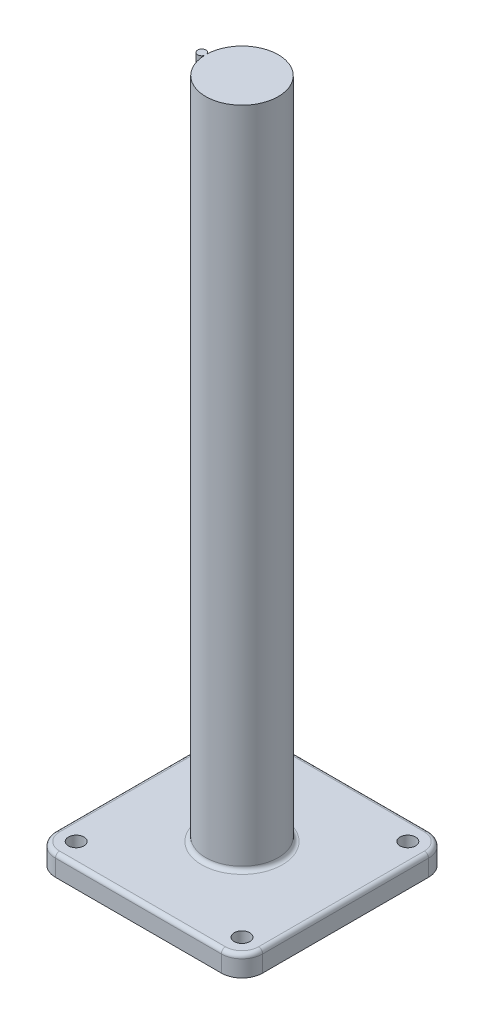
ISO-10303-21;
HEADER;
FILE_DESCRIPTION(('STEP AP214'),'2;1');
FILE_NAME('part.step','',(''),(''),'','','');
FILE_SCHEMA(('AUTOMOTIVE_DESIGN { 1 0 10303 214 1 1 1 1 }'));
ENDSEC;
DATA;
#1=APPLICATION_CONTEXT('core data for automotive mechanical design processes');
#2=APPLICATION_PROTOCOL_DEFINITION('international standard','automotive_design',2000,#1);
#3=PRODUCT_CONTEXT('',#1,'mechanical');
#4=PRODUCT('Part','Part','',(#3));
#5=PRODUCT_RELATED_PRODUCT_CATEGORY('part','',(#4));
#6=PRODUCT_DEFINITION_FORMATION('','',#4);
#7=PRODUCT_DEFINITION_CONTEXT('part definition',#1,'design');
#8=PRODUCT_DEFINITION('design','',#6,#7);
#9=PRODUCT_DEFINITION_SHAPE('','',#8);
#10=(LENGTH_UNIT() NAMED_UNIT(*) SI_UNIT(.MILLI.,.METRE.));
#11=(NAMED_UNIT(*) PLANE_ANGLE_UNIT() SI_UNIT($,.RADIAN.));
#12=(NAMED_UNIT(*) SI_UNIT($,.STERADIAN.) SOLID_ANGLE_UNIT());
#13=UNCERTAINTY_MEASURE_WITH_UNIT(LENGTH_MEASURE(1.E-05),#10,'distance_accuracy_value','');
#14=(GEOMETRIC_REPRESENTATION_CONTEXT(3) GLOBAL_UNCERTAINTY_ASSIGNED_CONTEXT((#13)) GLOBAL_UNIT_ASSIGNED_CONTEXT((#10,
#11,#12)) REPRESENTATION_CONTEXT('',''));
#15=CARTESIAN_POINT('',(0.,0.,0.));
#16=DIRECTION('',(0.,0.,1.));
#17=DIRECTION('',(1.,0.,0.));
#18=AXIS2_PLACEMENT_3D('',#15,#16,#17);
#19=CARTESIAN_POINT('',(50.8000000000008,12.6999999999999,50.8));
#20=DIRECTION('',(0.,0.999999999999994,0.));
#21=DIRECTION('',(0.,0.,1.));
#22=AXIS2_PLACEMENT_3D('',#19,#20,#21);
#23=PLANE('',#22);
#24=CARTESIAN_POINT('',(-24.6380000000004,12.6999999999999,0.));
#25=DIRECTION('',(0.,0.999999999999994,0.));
#26=DIRECTION('',(0.,0.,1.));
#27=AXIS2_PLACEMENT_3D('',#24,#25,#26);
#28=CIRCLE('',#27,2.54);
#29=CARTESIAN_POINT('',(-24.6343994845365,12.6999999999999,2.53999744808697));
#30=VERTEX_POINT('',#29);
#31=CARTESIAN_POINT('',(-24.6343994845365,12.6999999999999,-2.53999744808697));
#32=VERTEX_POINT('',#31);
#33=EDGE_CURVE('E148',#30,#32,#28,.F.);
#34=ORIENTED_EDGE('',*,*,#33,.T.);
#35=CARTESIAN_POINT('',(0.,12.6999999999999,0.));
#36=DIRECTION('',(0.,0.999999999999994,0.));
#37=DIRECTION('',(0.,0.,1.));
#38=AXIS2_PLACEMENT_3D('',#35,#36,#37);
#39=CIRCLE('',#38,24.765);
#40=EDGE_CURVE('E157',#32,#30,#39,.F.);
#41=ORIENTED_EDGE('',*,*,#40,.T.);
#42=EDGE_LOOP('',(#34,#41));
#43=FACE_BOUND('',#42,.T.);
#44=DIRECTION('',(0.,0.,1.));
#45=VECTOR('',#44,1.);
#46=CARTESIAN_POINT('',(-60.9600000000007,12.6999999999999,50.7999999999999));
#47=LINE('',#46,#45);
#48=CARTESIAN_POINT('',(-60.9600000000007,12.6999999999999,-50.7999999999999));
#49=VERTEX_POINT('',#48);
#50=CARTESIAN_POINT('',(-60.9600000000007,12.6999999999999,50.8));
#51=VERTEX_POINT('',#50);
#52=EDGE_CURVE('E179',#49,#51,#47,.T.);
#53=ORIENTED_EDGE('',*,*,#52,.T.);
#54=CARTESIAN_POINT('',(-50.8000000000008,12.6999999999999,50.8));
#55=DIRECTION('',(0.,0.999999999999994,0.));
#56=DIRECTION('',(0.,0.,1.));
#57=AXIS2_PLACEMENT_3D('',#54,#55,#56);
#58=CIRCLE('',#57,10.16);
#59=CARTESIAN_POINT('',(-50.8000000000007,12.6999999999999,60.96));
#60=VERTEX_POINT('',#59);
#61=EDGE_CURVE('E181',#51,#60,#58,.T.);
#62=ORIENTED_EDGE('',*,*,#61,.T.);
#63=DIRECTION('',(1.00000000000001,0.,0.));
#64=VECTOR('',#63,1.);
#65=CARTESIAN_POINT('',(50.8000000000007,12.6999999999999,60.96));
#66=LINE('',#65,#64);
#67=CARTESIAN_POINT('',(50.8000000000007,12.6999999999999,60.96));
#68=VERTEX_POINT('',#67);
#69=EDGE_CURVE('E161',#60,#68,#66,.T.);
#70=ORIENTED_EDGE('',*,*,#69,.T.);
#71=CARTESIAN_POINT('',(50.8000000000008,12.6999999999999,50.8));
#72=DIRECTION('',(0.,0.999999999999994,0.));
#73=DIRECTION('',(0.,0.,1.));
#74=AXIS2_PLACEMENT_3D('',#71,#72,#73);
#75=CIRCLE('',#74,10.16);
#76=CARTESIAN_POINT('',(60.9600000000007,12.6999999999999,50.7999999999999));
#77=VERTEX_POINT('',#76);
#78=EDGE_CURVE('E164',#68,#77,#75,.T.);
#79=ORIENTED_EDGE('',*,*,#78,.T.);
#80=DIRECTION('',(0.,0.,-1.));
#81=VECTOR('',#80,1.);
#82=CARTESIAN_POINT('',(60.9600000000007,12.6999999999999,-50.7999999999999));
#83=LINE('',#82,#81);
#84=CARTESIAN_POINT('',(60.9600000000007,12.6999999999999,-50.8));
#85=VERTEX_POINT('',#84);
#86=EDGE_CURVE('E171',#77,#85,#83,.T.);
#87=ORIENTED_EDGE('',*,*,#86,.T.);
#88=CARTESIAN_POINT('',(50.8000000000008,12.6999999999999,-50.8));
#89=DIRECTION('',(0.,0.999999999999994,0.));
#90=DIRECTION('',(0.,0.,1.));
#91=AXIS2_PLACEMENT_3D('',#88,#89,#90);
#92=CIRCLE('',#91,10.16);
#93=CARTESIAN_POINT('',(50.8000000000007,12.6999999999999,-60.96));
#94=VERTEX_POINT('',#93);
#95=EDGE_CURVE('E173',#85,#94,#92,.T.);
#96=ORIENTED_EDGE('',*,*,#95,.T.);
#97=DIRECTION('',(-1.00000000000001,0.,0.));
#98=VECTOR('',#97,1.);
#99=CARTESIAN_POINT('',(-50.8000000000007,12.6999999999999,-60.96));
#100=LINE('',#99,#98);
#101=CARTESIAN_POINT('',(-50.8000000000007,12.6999999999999,-60.96));
#102=VERTEX_POINT('',#101);
#103=EDGE_CURVE('E175',#94,#102,#100,.T.);
#104=ORIENTED_EDGE('',*,*,#103,.T.);
#105=CARTESIAN_POINT('',(-50.8000000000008,12.6999999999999,-50.8));
#106=DIRECTION('',(0.,0.999999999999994,0.));
#107=DIRECTION('',(0.,0.,1.));
#108=AXIS2_PLACEMENT_3D('',#105,#106,#107);
#109=CIRCLE('',#108,10.16);
#110=EDGE_CURVE('E177',#102,#49,#109,.T.);
#111=ORIENTED_EDGE('',*,*,#110,.T.);
#112=EDGE_LOOP('',(#53,#62,#70,#79,#87,#96,#104,#111));
#113=FACE_BOUND('',#112,.T.);
#114=CARTESIAN_POINT('',(50.8000000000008,12.6999999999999,50.8));
#115=DIRECTION('',(0.,0.999999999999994,0.));
#116=DIRECTION('',(0.,0.,1.));
#117=AXIS2_PLACEMENT_3D('',#114,#115,#116);
#118=CIRCLE('',#117,4.7625);
#119=CARTESIAN_POINT('',(50.8000000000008,12.6999999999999,46.0375));
#120=VERTEX_POINT('',#119);
#121=EDGE_CURVE('E351',#120,#120,#118,.T.);
#122=ORIENTED_EDGE('',*,*,#121,.F.);
#123=EDGE_LOOP('',(#122));
#124=FACE_BOUND('',#123,.T.);
#125=CARTESIAN_POINT('',(-50.8000000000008,12.6999999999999,-50.8));
#126=DIRECTION('',(0.,0.999999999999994,0.));
#127=DIRECTION('',(0.,0.,1.));
#128=AXIS2_PLACEMENT_3D('',#125,#126,#127);
#129=CIRCLE('',#128,4.7625);
#130=CARTESIAN_POINT('',(-50.8000000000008,12.6999999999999,-55.5625));
#131=VERTEX_POINT('',#130);
#132=EDGE_CURVE('E363',#131,#131,#129,.T.);
#133=ORIENTED_EDGE('',*,*,#132,.F.);
#134=EDGE_LOOP('',(#133));
#135=FACE_BOUND('',#134,.T.);
#136=CARTESIAN_POINT('',(50.8000000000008,12.6999999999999,-50.8));
#137=DIRECTION('',(0.,0.999999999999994,0.));
#138=DIRECTION('',(0.,0.,1.));
#139=AXIS2_PLACEMENT_3D('',#136,#137,#138);
#140=CIRCLE('',#139,4.7625);
#141=CARTESIAN_POINT('',(50.8000000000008,12.6999999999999,-55.5625));
#142=VERTEX_POINT('',#141);
#143=EDGE_CURVE('E357',#142,#142,#140,.T.);
#144=ORIENTED_EDGE('',*,*,#143,.F.);
#145=EDGE_LOOP('',(#144));
#146=FACE_BOUND('',#145,.T.);
#147=CARTESIAN_POINT('',(-50.8000000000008,12.6999999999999,50.8));
#148=DIRECTION('',(0.,0.999999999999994,0.));
#149=DIRECTION('',(0.,0.,1.));
#150=AXIS2_PLACEMENT_3D('',#147,#148,#149);
#151=CIRCLE('',#150,4.7625);
#152=CARTESIAN_POINT('',(-50.8000000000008,12.6999999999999,46.0375));
#153=VERTEX_POINT('',#152);
#154=EDGE_CURVE('E345',#153,#153,#151,.T.);
#155=ORIENTED_EDGE('',*,*,#154,.F.);
#156=EDGE_LOOP('',(#155));
#157=FACE_BOUND('',#156,.T.);
#158=ADVANCED_FACE('F36',(#43,#113,#124,#135,#146,#157),#23,.T.);
#159=CARTESIAN_POINT('',(50.8000000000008,0.,50.8));
#160=DIRECTION('',(0.,0.999999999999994,0.));
#161=DIRECTION('',(0.,0.,1.));
#162=AXIS2_PLACEMENT_3D('',#159,#160,#161);
#163=PLANE('',#162);
#164=CARTESIAN_POINT('',(50.8000000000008,0.,50.8));
#165=DIRECTION('',(0.,0.999999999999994,0.));
#166=DIRECTION('',(0.,0.,1.));
#167=AXIS2_PLACEMENT_3D('',#164,#165,#166);
#168=CIRCLE('',#167,4.7625);
#169=CARTESIAN_POINT('',(50.8000000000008,0.,46.0375));
#170=VERTEX_POINT('',#169);
#171=EDGE_CURVE('E348',#170,#170,#168,.T.);
#172=ORIENTED_EDGE('',*,*,#171,.T.);
#173=EDGE_LOOP('',(#172));
#174=FACE_BOUND('',#173,.T.);
#175=CARTESIAN_POINT('',(-50.8000000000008,0.,-50.8));
#176=DIRECTION('',(0.,0.999999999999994,0.));
#177=DIRECTION('',(0.,0.,1.));
#178=AXIS2_PLACEMENT_3D('',#175,#176,#177);
#179=CIRCLE('',#178,4.7625);
#180=CARTESIAN_POINT('',(-50.8000000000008,0.,-55.5625));
#181=VERTEX_POINT('',#180);
#182=EDGE_CURVE('E360',#181,#181,#179,.T.);
#183=ORIENTED_EDGE('',*,*,#182,.T.);
#184=EDGE_LOOP('',(#183));
#185=FACE_BOUND('',#184,.T.);
#186=CARTESIAN_POINT('',(50.8000000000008,0.,50.8));
#187=DIRECTION('',(0.,0.999999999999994,0.));
#188=DIRECTION('',(0.,0.,1.));
#189=AXIS2_PLACEMENT_3D('',#186,#187,#188);
#190=CIRCLE('',#189,12.7);
#191=CARTESIAN_POINT('',(50.8000000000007,0.,63.5));
#192=VERTEX_POINT('',#191);
#193=CARTESIAN_POINT('',(63.5000000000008,0.,50.7999999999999));
#194=VERTEX_POINT('',#193);
#195=EDGE_CURVE('E366',#192,#194,#190,.T.);
#196=ORIENTED_EDGE('',*,*,#195,.F.);
#197=DIRECTION('',(1.00000000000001,0.,0.));
#198=VECTOR('',#197,1.);
#199=CARTESIAN_POINT('',(-50.8000000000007,0.,63.5));
#200=LINE('',#199,#198);
#201=CARTESIAN_POINT('',(-50.8000000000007,0.,63.5));
#202=VERTEX_POINT('',#201);
#203=EDGE_CURVE('E379',#202,#192,#200,.T.);
#204=ORIENTED_EDGE('',*,*,#203,.F.);
#205=CARTESIAN_POINT('',(-50.8000000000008,0.,50.8));
#206=DIRECTION('',(0.,0.999999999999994,0.));
#207=DIRECTION('',(0.,0.,-1.));
#208=AXIS2_PLACEMENT_3D('',#205,#206,#207);
#209=CIRCLE('',#208,12.7);
#210=CARTESIAN_POINT('',(-63.5000000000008,0.,50.7999999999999));
#211=VERTEX_POINT('',#210);
#212=EDGE_CURVE('E302',#211,#202,#209,.T.);
#213=ORIENTED_EDGE('',*,*,#212,.F.);
#214=DIRECTION('',(0.,0.,1.));
#215=VECTOR('',#214,1.);
#216=CARTESIAN_POINT('',(-63.5000000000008,0.,50.7999999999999));
#217=LINE('',#216,#215);
#218=CARTESIAN_POINT('',(-63.5000000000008,0.,-50.7999999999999));
#219=VERTEX_POINT('',#218);
#220=EDGE_CURVE('E376',#219,#211,#217,.T.);
#221=ORIENTED_EDGE('',*,*,#220,.F.);
#222=CARTESIAN_POINT('',(-50.8000000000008,0.,-50.8));
#223=DIRECTION('',(0.,0.999999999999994,0.));
#224=DIRECTION('',(0.,0.,-1.));
#225=AXIS2_PLACEMENT_3D('',#222,#223,#224);
#226=CIRCLE('',#225,12.7);
#227=CARTESIAN_POINT('',(-50.8000000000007,0.,-63.5));
#228=VERTEX_POINT('',#227);
#229=EDGE_CURVE('E323',#228,#219,#226,.T.);
#230=ORIENTED_EDGE('',*,*,#229,.F.);
#231=DIRECTION('',(-1.00000000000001,0.,0.));
#232=VECTOR('',#231,1.);
#233=CARTESIAN_POINT('',(-50.8000000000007,0.,-63.5));
#234=LINE('',#233,#232);
#235=CARTESIAN_POINT('',(50.8000000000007,0.,-63.5));
#236=VERTEX_POINT('',#235);
#237=EDGE_CURVE('E372',#236,#228,#234,.T.);
#238=ORIENTED_EDGE('',*,*,#237,.F.);
#239=CARTESIAN_POINT('',(50.8000000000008,0.,-50.8));
#240=DIRECTION('',(0.,0.999999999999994,0.));
#241=DIRECTION('',(0.,0.,-1.));
#242=AXIS2_PLACEMENT_3D('',#239,#240,#241);
#243=CIRCLE('',#242,12.7);
#244=CARTESIAN_POINT('',(63.5000000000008,0.,-50.7999999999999));
#245=VERTEX_POINT('',#244);
#246=EDGE_CURVE('E370',#245,#236,#243,.T.);
#247=ORIENTED_EDGE('',*,*,#246,.F.);
#248=DIRECTION('',(0.,0.,-1.));
#249=VECTOR('',#248,1.);
#250=CARTESIAN_POINT('',(63.5000000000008,0.,50.7999999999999));
#251=LINE('',#250,#249);
#252=EDGE_CURVE('E257',#194,#245,#251,.T.);
#253=ORIENTED_EDGE('',*,*,#252,.F.);
#254=EDGE_LOOP('',(#196,#204,#213,#221,#230,#238,#247,#253));
#255=FACE_BOUND('',#254,.T.);
#256=CARTESIAN_POINT('',(50.8000000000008,0.,-50.8));
#257=DIRECTION('',(0.,0.999999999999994,0.));
#258=DIRECTION('',(0.,0.,1.));
#259=AXIS2_PLACEMENT_3D('',#256,#257,#258);
#260=CIRCLE('',#259,4.7625);
#261=CARTESIAN_POINT('',(50.8000000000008,0.,-55.5625));
#262=VERTEX_POINT('',#261);
#263=EDGE_CURVE('E354',#262,#262,#260,.T.);
#264=ORIENTED_EDGE('',*,*,#263,.T.);
#265=EDGE_LOOP('',(#264));
#266=FACE_BOUND('',#265,.T.);
#267=CARTESIAN_POINT('',(-50.8000000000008,0.,50.8));
#268=DIRECTION('',(0.,0.999999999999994,0.));
#269=DIRECTION('',(0.,0.,1.));
#270=AXIS2_PLACEMENT_3D('',#267,#268,#269);
#271=CIRCLE('',#270,4.7625);
#272=CARTESIAN_POINT('',(-50.8000000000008,0.,46.0375));
#273=VERTEX_POINT('',#272);
#274=EDGE_CURVE('E342',#273,#273,#271,.T.);
#275=ORIENTED_EDGE('',*,*,#274,.T.);
#276=EDGE_LOOP('',(#275));
#277=FACE_BOUND('',#276,.T.);
#278=ADVANCED_FACE('F213',(#174,#185,#255,#266,#277),#163,.F.);
#279=CARTESIAN_POINT('',(50.8000000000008,12.6999999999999,50.8));
#280=DIRECTION('',(0.,-0.999999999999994,0.));
#281=DIRECTION('',(0.,0.,-1.));
#282=AXIS2_PLACEMENT_3D('',#279,#280,#281);
#283=CYLINDRICAL_SURFACE('',#282,12.7);
#284=DIRECTION('',(0.,-0.999999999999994,0.));
#285=VECTOR('',#284,1.);
#286=CARTESIAN_POINT('',(63.5000000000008,12.6999999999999,50.7999999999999));
#287=LINE('',#286,#285);
#288=CARTESIAN_POINT('',(63.5000000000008,10.1599999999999,50.7999999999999));
#289=VERTEX_POINT('',#288);
#290=EDGE_CURVE('E162',#289,#194,#287,.T.);
#291=ORIENTED_EDGE('',*,*,#290,.F.);
#292=CARTESIAN_POINT('',(50.8000000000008,10.1599999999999,50.8));
#293=DIRECTION('',(0.,0.999999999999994,0.));
#294=DIRECTION('',(0.,0.,1.));
#295=AXIS2_PLACEMENT_3D('',#292,#293,#294);
#296=CIRCLE('',#295,12.7);
#297=CARTESIAN_POINT('',(50.8000000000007,10.1599999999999,63.5));
#298=VERTEX_POINT('',#297);
#299=EDGE_CURVE('E64',#289,#298,#296,.F.);
#300=ORIENTED_EDGE('',*,*,#299,.T.);
#301=DIRECTION('',(0.,-0.999999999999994,0.));
#302=VECTOR('',#301,1.);
#303=CARTESIAN_POINT('',(50.8000000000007,12.6999999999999,63.5));
#304=LINE('',#303,#302);
#305=EDGE_CURVE('E298',#298,#192,#304,.T.);
#306=ORIENTED_EDGE('',*,*,#305,.T.);
#307=ORIENTED_EDGE('',*,*,#195,.T.);
#308=EDGE_LOOP('',(#291,#300,#306,#307));
#309=FACE_BOUND('',#308,.T.);
#310=ADVANCED_FACE('F38',(#309),#283,.T.);
#311=CARTESIAN_POINT('',(63.5000000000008,12.6999999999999,50.7999999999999));
#312=DIRECTION('',(-1.00000000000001,0.,0.));
#313=DIRECTION('',(0.,0.,1.));
#314=AXIS2_PLACEMENT_3D('',#311,#312,#313);
#315=PLANE('',#314);
#316=DIRECTION('',(0.,-0.999999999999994,0.));
#317=VECTOR('',#316,1.);
#318=CARTESIAN_POINT('',(63.5000000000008,12.6999999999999,-50.7999999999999));
#319=LINE('',#318,#317);
#320=CARTESIAN_POINT('',(63.5000000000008,10.1599999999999,-50.7999999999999));
#321=VERTEX_POINT('',#320);
#322=EDGE_CURVE('E166',#321,#245,#319,.T.);
#323=ORIENTED_EDGE('',*,*,#322,.F.);
#324=DIRECTION('',(0.,0.,-1.));
#325=VECTOR('',#324,1.);
#326=CARTESIAN_POINT('',(63.5000000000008,10.1599999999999,50.7999999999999));
#327=LINE('',#326,#325);
#328=EDGE_CURVE('E195',#321,#289,#327,.F.);
#329=ORIENTED_EDGE('',*,*,#328,.T.);
#330=ORIENTED_EDGE('',*,*,#290,.T.);
#331=ORIENTED_EDGE('',*,*,#252,.T.);
#332=EDGE_LOOP('',(#323,#329,#330,#331));
#333=FACE_BOUND('',#332,.T.);
#334=ADVANCED_FACE('F245',(#333),#315,.F.);
#335=CARTESIAN_POINT('',(50.8000000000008,12.6999999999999,-50.8));
#336=DIRECTION('',(0.,-0.999999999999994,0.));
#337=DIRECTION('',(0.,0.,-1.));
#338=AXIS2_PLACEMENT_3D('',#335,#336,#337);
#339=CYLINDRICAL_SURFACE('',#338,12.7);
#340=DIRECTION('',(0.,-0.999999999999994,0.));
#341=VECTOR('',#340,1.);
#342=CARTESIAN_POINT('',(50.8000000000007,12.6999999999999,-63.5));
#343=LINE('',#342,#341);
#344=CARTESIAN_POINT('',(50.8000000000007,10.1599999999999,-63.5));
#345=VERTEX_POINT('',#344);
#346=EDGE_CURVE('E260',#345,#236,#343,.T.);
#347=ORIENTED_EDGE('',*,*,#346,.F.);
#348=CARTESIAN_POINT('',(50.8000000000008,10.1599999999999,-50.8));
#349=DIRECTION('',(0.,0.999999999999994,0.));
#350=DIRECTION('',(0.,0.,1.));
#351=AXIS2_PLACEMENT_3D('',#348,#349,#350);
#352=CIRCLE('',#351,12.7);
#353=EDGE_CURVE('E193',#345,#321,#352,.F.);
#354=ORIENTED_EDGE('',*,*,#353,.T.);
#355=ORIENTED_EDGE('',*,*,#322,.T.);
#356=ORIENTED_EDGE('',*,*,#246,.T.);
#357=EDGE_LOOP('',(#347,#354,#355,#356));
#358=FACE_BOUND('',#357,.T.);
#359=ADVANCED_FACE('F242',(#358),#339,.T.);
#360=CARTESIAN_POINT('',(-50.8000000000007,12.6999999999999,-63.5));
#361=DIRECTION('',(0.,0.,1.));
#362=DIRECTION('',(1.00000000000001,0.,0.));
#363=AXIS2_PLACEMENT_3D('',#360,#361,#362);
#364=PLANE('',#363);
#365=DIRECTION('',(0.,-0.999999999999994,0.));
#366=VECTOR('',#365,1.);
#367=CARTESIAN_POINT('',(-50.8000000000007,12.6999999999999,-63.5));
#368=LINE('',#367,#366);
#369=CARTESIAN_POINT('',(-50.8000000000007,10.1599999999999,-63.5));
#370=VERTEX_POINT('',#369);
#371=EDGE_CURVE('E325',#370,#228,#368,.T.);
#372=ORIENTED_EDGE('',*,*,#371,.F.);
#373=DIRECTION('',(-1.00000000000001,0.,0.));
#374=VECTOR('',#373,1.);
#375=CARTESIAN_POINT('',(50.8000000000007,10.1599999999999,-63.5));
#376=LINE('',#375,#374);
#377=EDGE_CURVE('E191',#370,#345,#376,.F.);
#378=ORIENTED_EDGE('',*,*,#377,.T.);
#379=ORIENTED_EDGE('',*,*,#346,.T.);
#380=ORIENTED_EDGE('',*,*,#237,.T.);
#381=EDGE_LOOP('',(#372,#378,#379,#380));
#382=FACE_BOUND('',#381,.T.);
#383=ADVANCED_FACE('F238',(#382),#364,.F.);
#384=CARTESIAN_POINT('',(-50.8000000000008,12.6999999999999,-50.8));
#385=DIRECTION('',(0.,-0.999999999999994,0.));
#386=DIRECTION('',(0.,0.,-1.));
#387=AXIS2_PLACEMENT_3D('',#384,#385,#386);
#388=CYLINDRICAL_SURFACE('',#387,12.7);
#389=DIRECTION('',(0.,-0.999999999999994,0.));
#390=VECTOR('',#389,1.);
#391=CARTESIAN_POINT('',(-63.5000000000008,12.6999999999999,-50.7999999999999));
#392=LINE('',#391,#390);
#393=CARTESIAN_POINT('',(-63.5000000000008,10.1599999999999,-50.7999999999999));
#394=VERTEX_POINT('',#393);
#395=EDGE_CURVE('E318',#394,#219,#392,.T.);
#396=ORIENTED_EDGE('',*,*,#395,.F.);
#397=CARTESIAN_POINT('',(-50.8000000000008,10.1599999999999,-50.8));
#398=DIRECTION('',(0.,0.999999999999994,0.));
#399=DIRECTION('',(0.,0.,1.));
#400=AXIS2_PLACEMENT_3D('',#397,#398,#399);
#401=CIRCLE('',#400,12.7);
#402=EDGE_CURVE('E189',#394,#370,#401,.F.);
#403=ORIENTED_EDGE('',*,*,#402,.T.);
#404=ORIENTED_EDGE('',*,*,#371,.T.);
#405=ORIENTED_EDGE('',*,*,#229,.T.);
#406=EDGE_LOOP('',(#396,#403,#404,#405));
#407=FACE_BOUND('',#406,.T.);
#408=ADVANCED_FACE('F234',(#407),#388,.T.);
#409=CARTESIAN_POINT('',(-63.5000000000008,12.6999999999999,50.7999999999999));
#410=DIRECTION('',(1.00000000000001,0.,0.));
#411=DIRECTION('',(0.,0.,-1.));
#412=AXIS2_PLACEMENT_3D('',#409,#410,#411);
#413=PLANE('',#412);
#414=DIRECTION('',(0.,-0.999999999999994,0.));
#415=VECTOR('',#414,1.);
#416=CARTESIAN_POINT('',(-63.5000000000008,12.6999999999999,50.7999999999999));
#417=LINE('',#416,#415);
#418=CARTESIAN_POINT('',(-63.5000000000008,10.1599999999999,50.7999999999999));
#419=VERTEX_POINT('',#418);
#420=EDGE_CURVE('E304',#419,#211,#417,.T.);
#421=ORIENTED_EDGE('',*,*,#420,.F.);
#422=DIRECTION('',(0.,0.,1.));
#423=VECTOR('',#422,1.);
#424=CARTESIAN_POINT('',(-63.5000000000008,10.1599999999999,-50.7999999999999));
#425=LINE('',#424,#423);
#426=EDGE_CURVE('E187',#419,#394,#425,.F.);
#427=ORIENTED_EDGE('',*,*,#426,.T.);
#428=ORIENTED_EDGE('',*,*,#395,.T.);
#429=ORIENTED_EDGE('',*,*,#220,.T.);
#430=EDGE_LOOP('',(#421,#427,#428,#429));
#431=FACE_BOUND('',#430,.T.);
#432=ADVANCED_FACE('F230',(#431),#413,.F.);
#433=CARTESIAN_POINT('',(-50.8000000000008,12.6999999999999,50.8));
#434=DIRECTION('',(0.,-0.999999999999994,0.));
#435=DIRECTION('',(0.,0.,-1.));
#436=AXIS2_PLACEMENT_3D('',#433,#434,#435);
#437=CYLINDRICAL_SURFACE('',#436,12.7);
#438=DIRECTION('',(0.,-0.999999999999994,0.));
#439=VECTOR('',#438,1.);
#440=CARTESIAN_POINT('',(-50.8000000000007,12.6999999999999,63.5));
#441=LINE('',#440,#439);
#442=CARTESIAN_POINT('',(-50.8000000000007,10.1599999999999,63.5));
#443=VERTEX_POINT('',#442);
#444=EDGE_CURVE('E296',#443,#202,#441,.T.);
#445=ORIENTED_EDGE('',*,*,#444,.F.);
#446=CARTESIAN_POINT('',(-50.8000000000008,10.1599999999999,50.8));
#447=DIRECTION('',(0.,0.999999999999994,0.));
#448=DIRECTION('',(0.,0.,1.));
#449=AXIS2_PLACEMENT_3D('',#446,#447,#448);
#450=CIRCLE('',#449,12.7);
#451=EDGE_CURVE('E184',#443,#419,#450,.F.);
#452=ORIENTED_EDGE('',*,*,#451,.T.);
#453=ORIENTED_EDGE('',*,*,#420,.T.);
#454=ORIENTED_EDGE('',*,*,#212,.T.);
#455=EDGE_LOOP('',(#445,#452,#453,#454));
#456=FACE_BOUND('',#455,.T.);
#457=ADVANCED_FACE('F226',(#456),#437,.T.);
#458=CARTESIAN_POINT('',(-50.8000000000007,12.6999999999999,63.5));
#459=DIRECTION('',(0.,0.,-1.));
#460=DIRECTION('',(-1.00000000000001,0.,0.));
#461=AXIS2_PLACEMENT_3D('',#458,#459,#460);
#462=PLANE('',#461);
#463=ORIENTED_EDGE('',*,*,#305,.F.);
#464=DIRECTION('',(1.00000000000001,0.,0.));
#465=VECTOR('',#464,1.);
#466=CARTESIAN_POINT('',(-50.8000000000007,10.1599999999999,63.5));
#467=LINE('',#466,#465);
#468=EDGE_CURVE('E198',#298,#443,#467,.F.);
#469=ORIENTED_EDGE('',*,*,#468,.T.);
#470=ORIENTED_EDGE('',*,*,#444,.T.);
#471=ORIENTED_EDGE('',*,*,#203,.T.);
#472=EDGE_LOOP('',(#463,#469,#470,#471));
#473=FACE_BOUND('',#472,.T.);
#474=ADVANCED_FACE('F222',(#473),#462,.F.);
#475=CARTESIAN_POINT('',(-50.8000000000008,12.6999999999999,-50.8));
#476=DIRECTION('',(0.,-0.999999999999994,0.));
#477=DIRECTION('',(0.,0.,-1.));
#478=AXIS2_PLACEMENT_3D('',#475,#476,#477);
#479=CYLINDRICAL_SURFACE('',#478,4.7625);
#480=CARTESIAN_POINT('',(-50.8000000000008,12.6999999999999,-55.5625));
#481=CARTESIAN_POINT('',(-50.8000000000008,12.5677083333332,-55.5625));
#482=CARTESIAN_POINT('',(-50.8000000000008,12.4354166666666,-55.5625));
#483=CARTESIAN_POINT('',(-50.8000000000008,12.1708333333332,-55.5625));
#484=CARTESIAN_POINT('',(-50.8000000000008,12.0385416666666,-55.5625));
#485=CARTESIAN_POINT('',(-50.8000000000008,11.7739583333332,-55.5625));
#486=CARTESIAN_POINT('',(-50.8000000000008,11.6416666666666,-55.5625));
#487=CARTESIAN_POINT('',(-50.8000000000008,11.3770833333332,-55.5625));
#488=CARTESIAN_POINT('',(-50.8000000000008,11.2447916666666,-55.5625));
#489=CARTESIAN_POINT('',(-50.8000000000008,10.9802083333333,-55.5625));
#490=CARTESIAN_POINT('',(-50.8000000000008,10.8479166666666,-55.5625));
#491=CARTESIAN_POINT('',(-50.8000000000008,10.5833333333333,-55.5625));
#492=CARTESIAN_POINT('',(-50.8000000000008,10.4510416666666,-55.5625));
#493=CARTESIAN_POINT('',(-50.8000000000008,10.1864583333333,-55.5625));
#494=CARTESIAN_POINT('',(-50.8000000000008,10.0541666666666,-55.5625));
#495=CARTESIAN_POINT('',(-50.8000000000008,9.78958333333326,-55.5625));
#496=CARTESIAN_POINT('',(-50.8000000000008,9.65729166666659,-55.5625));
#497=CARTESIAN_POINT('',(-50.8000000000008,9.39270833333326,-55.5625));
#498=CARTESIAN_POINT('',(-50.8000000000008,9.2604166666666,-55.5625));
#499=CARTESIAN_POINT('',(-50.8000000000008,8.99583333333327,-55.5625));
#500=CARTESIAN_POINT('',(-50.8000000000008,8.8635416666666,-55.5625));
#501=CARTESIAN_POINT('',(-50.8000000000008,8.59895833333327,-55.5625));
#502=CARTESIAN_POINT('',(-50.8000000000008,8.4666666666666,-55.5625));
#503=CARTESIAN_POINT('',(-50.8000000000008,8.20208333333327,-55.5625));
#504=CARTESIAN_POINT('',(-50.8000000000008,8.06979166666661,-55.5625));
#505=CARTESIAN_POINT('',(-50.8000000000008,7.80520833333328,-55.5625));
#506=CARTESIAN_POINT('',(-50.8000000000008,7.67291666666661,-55.5625));
#507=CARTESIAN_POINT('',(-50.8000000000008,7.40833333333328,-55.5625));
#508=CARTESIAN_POINT('',(-50.8000000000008,7.27604166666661,-55.5625));
#509=CARTESIAN_POINT('',(-50.8000000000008,7.01145833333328,-55.5625));
#510=CARTESIAN_POINT('',(-50.8000000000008,6.87916666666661,-55.5625));
#511=CARTESIAN_POINT('',(-50.8000000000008,6.61458333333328,-55.5625));
#512=CARTESIAN_POINT('',(-50.8000000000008,6.48229166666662,-55.5625));
#513=CARTESIAN_POINT('',(-50.8000000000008,6.21770833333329,-55.5625));
#514=CARTESIAN_POINT('',(-50.8000000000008,6.08541666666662,-55.5625));
#515=CARTESIAN_POINT('',(-50.8000000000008,5.82083333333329,-55.5625));
#516=CARTESIAN_POINT('',(-50.8000000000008,5.68854166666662,-55.5625));
#517=CARTESIAN_POINT('',(-50.8000000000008,5.42395833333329,-55.5625));
#518=CARTESIAN_POINT('',(-50.8000000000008,5.29166666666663,-55.5625));
#519=CARTESIAN_POINT('',(-50.8000000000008,5.0270833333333,-55.5625));
#520=CARTESIAN_POINT('',(-50.8000000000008,4.89479166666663,-55.5625));
#521=CARTESIAN_POINT('',(-50.8000000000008,4.6302083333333,-55.5625));
#522=CARTESIAN_POINT('',(-50.8000000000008,4.49791666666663,-55.5625));
#523=CARTESIAN_POINT('',(-50.8000000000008,4.2333333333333,-55.5625));
#524=CARTESIAN_POINT('',(-50.8000000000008,4.10104166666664,-55.5625));
#525=CARTESIAN_POINT('',(-50.8000000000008,3.8364583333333,-55.5625));
#526=CARTESIAN_POINT('',(-50.8000000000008,3.70416666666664,-55.5625));
#527=CARTESIAN_POINT('',(-50.8000000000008,3.43958333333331,-55.5625));
#528=CARTESIAN_POINT('',(-50.8000000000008,3.30729166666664,-55.5625));
#529=CARTESIAN_POINT('',(-50.8000000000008,3.04270833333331,-55.5625));
#530=CARTESIAN_POINT('',(-50.8000000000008,2.91041666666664,-55.5625));
#531=CARTESIAN_POINT('',(-50.8000000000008,2.64583333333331,-55.5625));
#532=CARTESIAN_POINT('',(-50.8000000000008,2.51354166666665,-55.5625));
#533=CARTESIAN_POINT('',(-50.8000000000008,2.24895833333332,-55.5625));
#534=CARTESIAN_POINT('',(-50.8000000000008,2.11666666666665,-55.5625));
#535=CARTESIAN_POINT('',(-50.8000000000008,1.85208333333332,-55.5625));
#536=CARTESIAN_POINT('',(-50.8000000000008,1.71979166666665,-55.5625));
#537=CARTESIAN_POINT('',(-50.8000000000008,1.45520833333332,-55.5625));
#538=CARTESIAN_POINT('',(-50.8000000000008,1.32291666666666,-55.5625));
#539=CARTESIAN_POINT('',(-50.8000000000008,1.05833333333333,-55.5625));
#540=CARTESIAN_POINT('',(-50.8000000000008,0.92604166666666,-55.5625));
#541=CARTESIAN_POINT('',(-50.8000000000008,0.661458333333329,-55.5625));
#542=CARTESIAN_POINT('',(-50.8000000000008,0.529166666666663,-55.5625));
#543=CARTESIAN_POINT('',(-50.8000000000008,0.264583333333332,-55.5625));
#544=CARTESIAN_POINT('',(-50.8000000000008,0.132291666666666,-55.5625));
#545=CARTESIAN_POINT('',(-50.8000000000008,0.,-55.5625));
#546=B_SPLINE_CURVE_WITH_KNOTS('',3,(#480,#481,#482,#483,#484,#485,#486,#487,#488,#489,#490,
#491,#492,#493,#494,#495,#496,#497,#498,#499,#500,#501,#502,#503,#504,#505,#506,#507,#508,#509,
#510,#511,#512,#513,#514,#515,#516,#517,#518,#519,#520,#521,#522,#523,#524,#525,#526,#527,#528,
#529,#530,#531,#532,#533,#534,#535,#536,#537,#538,#539,#540,#541,#542,#543,#544,#545),
.UNSPECIFIED.,.F.,.F.,(4,2,2,2,2,2,2,2,2,2,2,2,2,2,2,2,2,2,2,2,2,2,2,2,2,2,2,2,2,2,2,2,4),(0.,
0.396874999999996,0.793749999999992,1.19062499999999,1.58749999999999,1.98437499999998,
2.38124999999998,2.77812499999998,3.17499999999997,3.57187499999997,3.96874999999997,
4.36562499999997,4.76249999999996,5.15937499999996,5.55624999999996,5.95312499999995,
6.34999999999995,6.74687499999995,7.14374999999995,7.54062499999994,7.93749999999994,
8.33437499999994,8.73124999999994,9.12812499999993,9.52499999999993,9.92187499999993,
10.3187499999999,10.7156249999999,11.1124999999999,11.5093749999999,11.9062499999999,
12.3031249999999,12.6999999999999),.UNSPECIFIED.);
#547=EDGE_CURVE('BSEAM225',#131,#181,#546,.T.);
#548=ORIENTED_EDGE('',*,*,#132,.T.);
#549=ORIENTED_EDGE('',*,*,#182,.F.);
#550=ORIENTED_EDGE('',*,*,#547,.T.);
#551=ORIENTED_EDGE('',*,*,#547,.F.);
#552=EDGE_LOOP('',(#548,#550,#549,#551));
#553=FACE_BOUND('',#552,.T.);
#554=ADVANCED_FACE('F225',(#553),#479,.F.);
#555=CARTESIAN_POINT('',(50.8000000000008,12.6999999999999,-50.8));
#556=DIRECTION('',(0.,-0.999999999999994,0.));
#557=DIRECTION('',(0.,0.,-1.));
#558=AXIS2_PLACEMENT_3D('',#555,#556,#557);
#559=CYLINDRICAL_SURFACE('',#558,4.7625);
#560=CARTESIAN_POINT('',(50.8000000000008,12.6999999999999,-55.5625));
#561=CARTESIAN_POINT('',(50.8000000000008,12.5677083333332,-55.5625));
#562=CARTESIAN_POINT('',(50.8000000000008,12.4354166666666,-55.5625));
#563=CARTESIAN_POINT('',(50.8000000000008,12.1708333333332,-55.5625));
#564=CARTESIAN_POINT('',(50.8000000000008,12.0385416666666,-55.5625));
#565=CARTESIAN_POINT('',(50.8000000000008,11.7739583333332,-55.5625));
#566=CARTESIAN_POINT('',(50.8000000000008,11.6416666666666,-55.5625));
#567=CARTESIAN_POINT('',(50.8000000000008,11.3770833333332,-55.5625));
#568=CARTESIAN_POINT('',(50.8000000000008,11.2447916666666,-55.5625));
#569=CARTESIAN_POINT('',(50.8000000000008,10.9802083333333,-55.5625));
#570=CARTESIAN_POINT('',(50.8000000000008,10.8479166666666,-55.5625));
#571=CARTESIAN_POINT('',(50.8000000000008,10.5833333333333,-55.5625));
#572=CARTESIAN_POINT('',(50.8000000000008,10.4510416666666,-55.5625));
#573=CARTESIAN_POINT('',(50.8000000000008,10.1864583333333,-55.5625));
#574=CARTESIAN_POINT('',(50.8000000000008,10.0541666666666,-55.5625));
#575=CARTESIAN_POINT('',(50.8000000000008,9.78958333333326,-55.5625));
#576=CARTESIAN_POINT('',(50.8000000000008,9.65729166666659,-55.5625));
#577=CARTESIAN_POINT('',(50.8000000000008,9.39270833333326,-55.5625));
#578=CARTESIAN_POINT('',(50.8000000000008,9.2604166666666,-55.5625));
#579=CARTESIAN_POINT('',(50.8000000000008,8.99583333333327,-55.5625));
#580=CARTESIAN_POINT('',(50.8000000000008,8.8635416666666,-55.5625));
#581=CARTESIAN_POINT('',(50.8000000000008,8.59895833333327,-55.5625));
#582=CARTESIAN_POINT('',(50.8000000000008,8.4666666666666,-55.5625));
#583=CARTESIAN_POINT('',(50.8000000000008,8.20208333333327,-55.5625));
#584=CARTESIAN_POINT('',(50.8000000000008,8.06979166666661,-55.5625));
#585=CARTESIAN_POINT('',(50.8000000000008,7.80520833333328,-55.5625));
#586=CARTESIAN_POINT('',(50.8000000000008,7.67291666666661,-55.5625));
#587=CARTESIAN_POINT('',(50.8000000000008,7.40833333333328,-55.5625));
#588=CARTESIAN_POINT('',(50.8000000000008,7.27604166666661,-55.5625));
#589=CARTESIAN_POINT('',(50.8000000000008,7.01145833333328,-55.5625));
#590=CARTESIAN_POINT('',(50.8000000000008,6.87916666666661,-55.5625));
#591=CARTESIAN_POINT('',(50.8000000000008,6.61458333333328,-55.5625));
#592=CARTESIAN_POINT('',(50.8000000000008,6.48229166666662,-55.5625));
#593=CARTESIAN_POINT('',(50.8000000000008,6.21770833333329,-55.5625));
#594=CARTESIAN_POINT('',(50.8000000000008,6.08541666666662,-55.5625));
#595=CARTESIAN_POINT('',(50.8000000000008,5.82083333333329,-55.5625));
#596=CARTESIAN_POINT('',(50.8000000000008,5.68854166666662,-55.5625));
#597=CARTESIAN_POINT('',(50.8000000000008,5.42395833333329,-55.5625));
#598=CARTESIAN_POINT('',(50.8000000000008,5.29166666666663,-55.5625));
#599=CARTESIAN_POINT('',(50.8000000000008,5.0270833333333,-55.5625));
#600=CARTESIAN_POINT('',(50.8000000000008,4.89479166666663,-55.5625));
#601=CARTESIAN_POINT('',(50.8000000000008,4.6302083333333,-55.5625));
#602=CARTESIAN_POINT('',(50.8000000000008,4.49791666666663,-55.5625));
#603=CARTESIAN_POINT('',(50.8000000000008,4.2333333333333,-55.5625));
#604=CARTESIAN_POINT('',(50.8000000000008,4.10104166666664,-55.5625));
#605=CARTESIAN_POINT('',(50.8000000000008,3.8364583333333,-55.5625));
#606=CARTESIAN_POINT('',(50.8000000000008,3.70416666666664,-55.5625));
#607=CARTESIAN_POINT('',(50.8000000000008,3.43958333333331,-55.5625));
#608=CARTESIAN_POINT('',(50.8000000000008,3.30729166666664,-55.5625));
#609=CARTESIAN_POINT('',(50.8000000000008,3.04270833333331,-55.5625));
#610=CARTESIAN_POINT('',(50.8000000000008,2.91041666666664,-55.5625));
#611=CARTESIAN_POINT('',(50.8000000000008,2.64583333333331,-55.5625));
#612=CARTESIAN_POINT('',(50.8000000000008,2.51354166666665,-55.5625));
#613=CARTESIAN_POINT('',(50.8000000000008,2.24895833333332,-55.5625));
#614=CARTESIAN_POINT('',(50.8000000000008,2.11666666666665,-55.5625));
#615=CARTESIAN_POINT('',(50.8000000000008,1.85208333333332,-55.5625));
#616=CARTESIAN_POINT('',(50.8000000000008,1.71979166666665,-55.5625));
#617=CARTESIAN_POINT('',(50.8000000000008,1.45520833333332,-55.5625));
#618=CARTESIAN_POINT('',(50.8000000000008,1.32291666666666,-55.5625));
#619=CARTESIAN_POINT('',(50.8000000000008,1.05833333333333,-55.5625));
#620=CARTESIAN_POINT('',(50.8000000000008,0.92604166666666,-55.5625));
#621=CARTESIAN_POINT('',(50.8000000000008,0.661458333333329,-55.5625));
#622=CARTESIAN_POINT('',(50.8000000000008,0.529166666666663,-55.5625));
#623=CARTESIAN_POINT('',(50.8000000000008,0.264583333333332,-55.5625));
#624=CARTESIAN_POINT('',(50.8000000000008,0.132291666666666,-55.5625));
#625=CARTESIAN_POINT('',(50.8000000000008,0.,-55.5625));
#626=B_SPLINE_CURVE_WITH_KNOTS('',3,(#560,#561,#562,#563,#564,#565,#566,#567,#568,#569,#570,
#571,#572,#573,#574,#575,#576,#577,#578,#579,#580,#581,#582,#583,#584,#585,#586,#587,#588,#589,
#590,#591,#592,#593,#594,#595,#596,#597,#598,#599,#600,#601,#602,#603,#604,#605,#606,#607,#608,
#609,#610,#611,#612,#613,#614,#615,#616,#617,#618,#619,#620,#621,#622,#623,#624,#625),
.UNSPECIFIED.,.F.,.F.,(4,2,2,2,2,2,2,2,2,2,2,2,2,2,2,2,2,2,2,2,2,2,2,2,2,2,2,2,2,2,2,2,4),(0.,
0.396874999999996,0.793749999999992,1.19062499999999,1.58749999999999,1.98437499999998,
2.38124999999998,2.77812499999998,3.17499999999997,3.57187499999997,3.96874999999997,
4.36562499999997,4.76249999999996,5.15937499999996,5.55624999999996,5.95312499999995,
6.34999999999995,6.74687499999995,7.14374999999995,7.54062499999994,7.93749999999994,
8.33437499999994,8.73124999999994,9.12812499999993,9.52499999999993,9.92187499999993,
10.3187499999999,10.7156249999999,11.1124999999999,11.5093749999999,11.9062499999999,
12.3031249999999,12.6999999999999),.UNSPECIFIED.);
#627=EDGE_CURVE('BSEAM406',#142,#262,#626,.T.);
#628=ORIENTED_EDGE('',*,*,#143,.T.);
#629=ORIENTED_EDGE('',*,*,#263,.F.);
#630=ORIENTED_EDGE('',*,*,#627,.T.);
#631=ORIENTED_EDGE('',*,*,#627,.F.);
#632=EDGE_LOOP('',(#628,#630,#629,#631));
#633=FACE_BOUND('',#632,.T.);
#634=ADVANCED_FACE('F406',(#633),#559,.F.);
#635=CARTESIAN_POINT('',(50.8000000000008,12.6999999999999,50.8));
#636=DIRECTION('',(0.,-0.999999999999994,0.));
#637=DIRECTION('',(0.,0.,-1.));
#638=AXIS2_PLACEMENT_3D('',#635,#636,#637);
#639=CYLINDRICAL_SURFACE('',#638,4.7625);
#640=CARTESIAN_POINT('',(50.8000000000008,12.6999999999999,46.0375));
#641=CARTESIAN_POINT('',(50.8000000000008,12.5677083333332,46.0375));
#642=CARTESIAN_POINT('',(50.8000000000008,12.4354166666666,46.0375));
#643=CARTESIAN_POINT('',(50.8000000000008,12.1708333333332,46.0375));
#644=CARTESIAN_POINT('',(50.8000000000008,12.0385416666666,46.0375));
#645=CARTESIAN_POINT('',(50.8000000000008,11.7739583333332,46.0375));
#646=CARTESIAN_POINT('',(50.8000000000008,11.6416666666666,46.0375));
#647=CARTESIAN_POINT('',(50.8000000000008,11.3770833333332,46.0375));
#648=CARTESIAN_POINT('',(50.8000000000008,11.2447916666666,46.0375));
#649=CARTESIAN_POINT('',(50.8000000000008,10.9802083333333,46.0375));
#650=CARTESIAN_POINT('',(50.8000000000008,10.8479166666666,46.0375));
#651=CARTESIAN_POINT('',(50.8000000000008,10.5833333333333,46.0375));
#652=CARTESIAN_POINT('',(50.8000000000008,10.4510416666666,46.0375));
#653=CARTESIAN_POINT('',(50.8000000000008,10.1864583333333,46.0375));
#654=CARTESIAN_POINT('',(50.8000000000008,10.0541666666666,46.0375));
#655=CARTESIAN_POINT('',(50.8000000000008,9.78958333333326,46.0375));
#656=CARTESIAN_POINT('',(50.8000000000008,9.65729166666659,46.0375));
#657=CARTESIAN_POINT('',(50.8000000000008,9.39270833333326,46.0375));
#658=CARTESIAN_POINT('',(50.8000000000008,9.2604166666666,46.0375));
#659=CARTESIAN_POINT('',(50.8000000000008,8.99583333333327,46.0375));
#660=CARTESIAN_POINT('',(50.8000000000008,8.8635416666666,46.0375));
#661=CARTESIAN_POINT('',(50.8000000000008,8.59895833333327,46.0375));
#662=CARTESIAN_POINT('',(50.8000000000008,8.4666666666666,46.0375));
#663=CARTESIAN_POINT('',(50.8000000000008,8.20208333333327,46.0375));
#664=CARTESIAN_POINT('',(50.8000000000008,8.06979166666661,46.0375));
#665=CARTESIAN_POINT('',(50.8000000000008,7.80520833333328,46.0375));
#666=CARTESIAN_POINT('',(50.8000000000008,7.67291666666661,46.0375));
#667=CARTESIAN_POINT('',(50.8000000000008,7.40833333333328,46.0375));
#668=CARTESIAN_POINT('',(50.8000000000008,7.27604166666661,46.0375));
#669=CARTESIAN_POINT('',(50.8000000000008,7.01145833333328,46.0375));
#670=CARTESIAN_POINT('',(50.8000000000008,6.87916666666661,46.0375));
#671=CARTESIAN_POINT('',(50.8000000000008,6.61458333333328,46.0375));
#672=CARTESIAN_POINT('',(50.8000000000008,6.48229166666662,46.0375));
#673=CARTESIAN_POINT('',(50.8000000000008,6.21770833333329,46.0375));
#674=CARTESIAN_POINT('',(50.8000000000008,6.08541666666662,46.0375));
#675=CARTESIAN_POINT('',(50.8000000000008,5.82083333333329,46.0375));
#676=CARTESIAN_POINT('',(50.8000000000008,5.68854166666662,46.0375));
#677=CARTESIAN_POINT('',(50.8000000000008,5.42395833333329,46.0375));
#678=CARTESIAN_POINT('',(50.8000000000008,5.29166666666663,46.0375));
#679=CARTESIAN_POINT('',(50.8000000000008,5.0270833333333,46.0375));
#680=CARTESIAN_POINT('',(50.8000000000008,4.89479166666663,46.0375));
#681=CARTESIAN_POINT('',(50.8000000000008,4.6302083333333,46.0375));
#682=CARTESIAN_POINT('',(50.8000000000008,4.49791666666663,46.0375));
#683=CARTESIAN_POINT('',(50.8000000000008,4.2333333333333,46.0375));
#684=CARTESIAN_POINT('',(50.8000000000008,4.10104166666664,46.0375));
#685=CARTESIAN_POINT('',(50.8000000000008,3.8364583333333,46.0375));
#686=CARTESIAN_POINT('',(50.8000000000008,3.70416666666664,46.0375));
#687=CARTESIAN_POINT('',(50.8000000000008,3.43958333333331,46.0375));
#688=CARTESIAN_POINT('',(50.8000000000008,3.30729166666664,46.0375));
#689=CARTESIAN_POINT('',(50.8000000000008,3.04270833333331,46.0375));
#690=CARTESIAN_POINT('',(50.8000000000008,2.91041666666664,46.0375));
#691=CARTESIAN_POINT('',(50.8000000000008,2.64583333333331,46.0375));
#692=CARTESIAN_POINT('',(50.8000000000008,2.51354166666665,46.0375));
#693=CARTESIAN_POINT('',(50.8000000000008,2.24895833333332,46.0375));
#694=CARTESIAN_POINT('',(50.8000000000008,2.11666666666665,46.0375));
#695=CARTESIAN_POINT('',(50.8000000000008,1.85208333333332,46.0375));
#696=CARTESIAN_POINT('',(50.8000000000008,1.71979166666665,46.0375));
#697=CARTESIAN_POINT('',(50.8000000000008,1.45520833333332,46.0375));
#698=CARTESIAN_POINT('',(50.8000000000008,1.32291666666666,46.0375));
#699=CARTESIAN_POINT('',(50.8000000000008,1.05833333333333,46.0375));
#700=CARTESIAN_POINT('',(50.8000000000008,0.92604166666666,46.0375));
#701=CARTESIAN_POINT('',(50.8000000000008,0.661458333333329,46.0375));
#702=CARTESIAN_POINT('',(50.8000000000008,0.529166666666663,46.0375));
#703=CARTESIAN_POINT('',(50.8000000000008,0.264583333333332,46.0375));
#704=CARTESIAN_POINT('',(50.8000000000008,0.132291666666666,46.0375));
#705=CARTESIAN_POINT('',(50.8000000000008,0.,46.0375));
#706=B_SPLINE_CURVE_WITH_KNOTS('',3,(#640,#641,#642,#643,#644,#645,#646,#647,#648,#649,#650,
#651,#652,#653,#654,#655,#656,#657,#658,#659,#660,#661,#662,#663,#664,#665,#666,#667,#668,#669,
#670,#671,#672,#673,#674,#675,#676,#677,#678,#679,#680,#681,#682,#683,#684,#685,#686,#687,#688,
#689,#690,#691,#692,#693,#694,#695,#696,#697,#698,#699,#700,#701,#702,#703,#704,#705),
.UNSPECIFIED.,.F.,.F.,(4,2,2,2,2,2,2,2,2,2,2,2,2,2,2,2,2,2,2,2,2,2,2,2,2,2,2,2,2,2,2,2,4),(0.,
0.396874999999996,0.793749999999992,1.19062499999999,1.58749999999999,1.98437499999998,
2.38124999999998,2.77812499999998,3.17499999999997,3.57187499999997,3.96874999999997,
4.36562499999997,4.76249999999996,5.15937499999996,5.55624999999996,5.95312499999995,
6.34999999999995,6.74687499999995,7.14374999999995,7.54062499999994,7.93749999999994,
8.33437499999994,8.73124999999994,9.12812499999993,9.52499999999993,9.92187499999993,
10.3187499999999,10.7156249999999,11.1124999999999,11.5093749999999,11.9062499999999,
12.3031249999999,12.6999999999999),.UNSPECIFIED.);
#707=EDGE_CURVE('BSEAM396',#120,#170,#706,.T.);
#708=ORIENTED_EDGE('',*,*,#121,.T.);
#709=ORIENTED_EDGE('',*,*,#171,.F.);
#710=ORIENTED_EDGE('',*,*,#707,.T.);
#711=ORIENTED_EDGE('',*,*,#707,.F.);
#712=EDGE_LOOP('',(#708,#710,#709,#711));
#713=FACE_BOUND('',#712,.T.);
#714=ADVANCED_FACE('F396',(#713),#639,.F.);
#715=CARTESIAN_POINT('',(-50.8000000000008,12.6999999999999,50.8));
#716=DIRECTION('',(0.,-0.999999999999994,0.));
#717=DIRECTION('',(0.,0.,-1.));
#718=AXIS2_PLACEMENT_3D('',#715,#716,#717);
#719=CYLINDRICAL_SURFACE('',#718,4.7625);
#720=CARTESIAN_POINT('',(-50.8000000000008,12.6999999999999,46.0375));
#721=CARTESIAN_POINT('',(-50.8000000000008,12.5677083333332,46.0375));
#722=CARTESIAN_POINT('',(-50.8000000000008,12.4354166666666,46.0375));
#723=CARTESIAN_POINT('',(-50.8000000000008,12.1708333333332,46.0375));
#724=CARTESIAN_POINT('',(-50.8000000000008,12.0385416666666,46.0375));
#725=CARTESIAN_POINT('',(-50.8000000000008,11.7739583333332,46.0375));
#726=CARTESIAN_POINT('',(-50.8000000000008,11.6416666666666,46.0375));
#727=CARTESIAN_POINT('',(-50.8000000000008,11.3770833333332,46.0375));
#728=CARTESIAN_POINT('',(-50.8000000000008,11.2447916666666,46.0375));
#729=CARTESIAN_POINT('',(-50.8000000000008,10.9802083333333,46.0375));
#730=CARTESIAN_POINT('',(-50.8000000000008,10.8479166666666,46.0375));
#731=CARTESIAN_POINT('',(-50.8000000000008,10.5833333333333,46.0375));
#732=CARTESIAN_POINT('',(-50.8000000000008,10.4510416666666,46.0375));
#733=CARTESIAN_POINT('',(-50.8000000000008,10.1864583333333,46.0375));
#734=CARTESIAN_POINT('',(-50.8000000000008,10.0541666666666,46.0375));
#735=CARTESIAN_POINT('',(-50.8000000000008,9.78958333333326,46.0375));
#736=CARTESIAN_POINT('',(-50.8000000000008,9.65729166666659,46.0375));
#737=CARTESIAN_POINT('',(-50.8000000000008,9.39270833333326,46.0375));
#738=CARTESIAN_POINT('',(-50.8000000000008,9.2604166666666,46.0375));
#739=CARTESIAN_POINT('',(-50.8000000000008,8.99583333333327,46.0375));
#740=CARTESIAN_POINT('',(-50.8000000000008,8.8635416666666,46.0375));
#741=CARTESIAN_POINT('',(-50.8000000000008,8.59895833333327,46.0375));
#742=CARTESIAN_POINT('',(-50.8000000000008,8.4666666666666,46.0375));
#743=CARTESIAN_POINT('',(-50.8000000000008,8.20208333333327,46.0375));
#744=CARTESIAN_POINT('',(-50.8000000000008,8.06979166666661,46.0375));
#745=CARTESIAN_POINT('',(-50.8000000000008,7.80520833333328,46.0375));
#746=CARTESIAN_POINT('',(-50.8000000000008,7.67291666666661,46.0375));
#747=CARTESIAN_POINT('',(-50.8000000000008,7.40833333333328,46.0375));
#748=CARTESIAN_POINT('',(-50.8000000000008,7.27604166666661,46.0375));
#749=CARTESIAN_POINT('',(-50.8000000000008,7.01145833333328,46.0375));
#750=CARTESIAN_POINT('',(-50.8000000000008,6.87916666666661,46.0375));
#751=CARTESIAN_POINT('',(-50.8000000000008,6.61458333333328,46.0375));
#752=CARTESIAN_POINT('',(-50.8000000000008,6.48229166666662,46.0375));
#753=CARTESIAN_POINT('',(-50.8000000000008,6.21770833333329,46.0375));
#754=CARTESIAN_POINT('',(-50.8000000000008,6.08541666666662,46.0375));
#755=CARTESIAN_POINT('',(-50.8000000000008,5.82083333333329,46.0375));
#756=CARTESIAN_POINT('',(-50.8000000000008,5.68854166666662,46.0375));
#757=CARTESIAN_POINT('',(-50.8000000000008,5.42395833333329,46.0375));
#758=CARTESIAN_POINT('',(-50.8000000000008,5.29166666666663,46.0375));
#759=CARTESIAN_POINT('',(-50.8000000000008,5.0270833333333,46.0375));
#760=CARTESIAN_POINT('',(-50.8000000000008,4.89479166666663,46.0375));
#761=CARTESIAN_POINT('',(-50.8000000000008,4.6302083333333,46.0375));
#762=CARTESIAN_POINT('',(-50.8000000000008,4.49791666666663,46.0375));
#763=CARTESIAN_POINT('',(-50.8000000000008,4.2333333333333,46.0375));
#764=CARTESIAN_POINT('',(-50.8000000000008,4.10104166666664,46.0375));
#765=CARTESIAN_POINT('',(-50.8000000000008,3.8364583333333,46.0375));
#766=CARTESIAN_POINT('',(-50.8000000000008,3.70416666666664,46.0375));
#767=CARTESIAN_POINT('',(-50.8000000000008,3.43958333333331,46.0375));
#768=CARTESIAN_POINT('',(-50.8000000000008,3.30729166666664,46.0375));
#769=CARTESIAN_POINT('',(-50.8000000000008,3.04270833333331,46.0375));
#770=CARTESIAN_POINT('',(-50.8000000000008,2.91041666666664,46.0375));
#771=CARTESIAN_POINT('',(-50.8000000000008,2.64583333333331,46.0375));
#772=CARTESIAN_POINT('',(-50.8000000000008,2.51354166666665,46.0375));
#773=CARTESIAN_POINT('',(-50.8000000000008,2.24895833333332,46.0375));
#774=CARTESIAN_POINT('',(-50.8000000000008,2.11666666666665,46.0375));
#775=CARTESIAN_POINT('',(-50.8000000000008,1.85208333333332,46.0375));
#776=CARTESIAN_POINT('',(-50.8000000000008,1.71979166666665,46.0375));
#777=CARTESIAN_POINT('',(-50.8000000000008,1.45520833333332,46.0375));
#778=CARTESIAN_POINT('',(-50.8000000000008,1.32291666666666,46.0375));
#779=CARTESIAN_POINT('',(-50.8000000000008,1.05833333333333,46.0375));
#780=CARTESIAN_POINT('',(-50.8000000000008,0.92604166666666,46.0375));
#781=CARTESIAN_POINT('',(-50.8000000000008,0.661458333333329,46.0375));
#782=CARTESIAN_POINT('',(-50.8000000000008,0.529166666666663,46.0375));
#783=CARTESIAN_POINT('',(-50.8000000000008,0.264583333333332,46.0375));
#784=CARTESIAN_POINT('',(-50.8000000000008,0.132291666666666,46.0375));
#785=CARTESIAN_POINT('',(-50.8000000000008,0.,46.0375));
#786=B_SPLINE_CURVE_WITH_KNOTS('',3,(#720,#721,#722,#723,#724,#725,#726,#727,#728,#729,#730,
#731,#732,#733,#734,#735,#736,#737,#738,#739,#740,#741,#742,#743,#744,#745,#746,#747,#748,#749,
#750,#751,#752,#753,#754,#755,#756,#757,#758,#759,#760,#761,#762,#763,#764,#765,#766,#767,#768,
#769,#770,#771,#772,#773,#774,#775,#776,#777,#778,#779,#780,#781,#782,#783,#784,#785),
.UNSPECIFIED.,.F.,.F.,(4,2,2,2,2,2,2,2,2,2,2,2,2,2,2,2,2,2,2,2,2,2,2,2,2,2,2,2,2,2,2,2,4),(0.,
0.396874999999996,0.793749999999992,1.19062499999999,1.58749999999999,1.98437499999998,
2.38124999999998,2.77812499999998,3.17499999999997,3.57187499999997,3.96874999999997,
4.36562499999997,4.76249999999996,5.15937499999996,5.55624999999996,5.95312499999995,
6.34999999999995,6.74687499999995,7.14374999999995,7.54062499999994,7.93749999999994,
8.33437499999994,8.73124999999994,9.12812499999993,9.52499999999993,9.92187499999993,
10.3187499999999,10.7156249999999,11.1124999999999,11.5093749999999,11.9062499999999,
12.3031249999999,12.6999999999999),.UNSPECIFIED.);
#787=EDGE_CURVE('BSEAM393',#153,#273,#786,.T.);
#788=ORIENTED_EDGE('',*,*,#154,.T.);
#789=ORIENTED_EDGE('',*,*,#274,.F.);
#790=ORIENTED_EDGE('',*,*,#787,.T.);
#791=ORIENTED_EDGE('',*,*,#787,.F.);
#792=EDGE_LOOP('',(#788,#790,#789,#791));
#793=FACE_BOUND('',#792,.T.);
#794=ADVANCED_FACE('F393',(#793),#719,.F.);
#795=CARTESIAN_POINT('',(0.,0.,0.));
#796=DIRECTION('',(0.,-0.999999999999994,0.));
#797=DIRECTION('',(0.,0.,-1.));
#798=AXIS2_PLACEMENT_3D('',#795,#796,#797);
#799=CYLINDRICAL_SURFACE('',#798,22.225);
#800=DIRECTION('',(0.,0.999999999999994,0.));
#801=VECTOR('',#800,1.);
#802=CARTESIAN_POINT('',(-22.2122345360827,215.899999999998,-0.753167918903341));
#803=LINE('',#802,#801);
#804=CARTESIAN_POINT('',(-22.2122345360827,419.099999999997,-0.753167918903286));
#805=VERTEX_POINT('',#804);
#806=CARTESIAN_POINT('',(-22.2122345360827,15.2399999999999,-0.753167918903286));
#807=VERTEX_POINT('',#806);
#808=EDGE_CURVE('E56',#805,#807,#803,.F.);
#809=ORIENTED_EDGE('',*,*,#808,.F.);
#810=CARTESIAN_POINT('',(0.,419.099999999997,0.));
#811=DIRECTION('',(0.,-0.999999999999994,0.));
#812=DIRECTION('',(0.,0.,-1.));
#813=AXIS2_PLACEMENT_3D('',#810,#811,#812);
#814=CIRCLE('',#813,22.225);
#815=CARTESIAN_POINT('',(-22.2122345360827,419.099999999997,0.753167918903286));
#816=VERTEX_POINT('',#815);
#817=EDGE_CURVE('E339',#805,#816,#814,.T.);
#818=ORIENTED_EDGE('',*,*,#817,.T.);
#819=DIRECTION('',(0.,0.999999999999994,0.));
#820=VECTOR('',#819,1.);
#821=CARTESIAN_POINT('',(-22.2122345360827,215.899999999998,0.753167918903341));
#822=LINE('',#821,#820);
#823=CARTESIAN_POINT('',(-22.2122345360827,15.2399999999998,0.753167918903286));
#824=VERTEX_POINT('',#823);
#825=EDGE_CURVE('E543',#824,#816,#822,.T.);
#826=ORIENTED_EDGE('',*,*,#825,.F.);
#827=CARTESIAN_POINT('',(0.,15.2399999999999,0.));
#828=DIRECTION('',(0.,0.999999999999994,0.));
#829=DIRECTION('',(0.,0.,1.));
#830=AXIS2_PLACEMENT_3D('',#827,#828,#829);
#831=CIRCLE('',#830,22.225);
#832=EDGE_CURVE('E153',#824,#807,#831,.T.);
#833=ORIENTED_EDGE('',*,*,#832,.T.);
#834=EDGE_LOOP('',(#809,#818,#826,#833));
#835=FACE_BOUND('',#834,.T.);
#836=ADVANCED_FACE('F395',(#835),#799,.T.);
#837=CARTESIAN_POINT('',(0.,419.099999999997,0.));
#838=DIRECTION('',(0.,0.999999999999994,0.));
#839=DIRECTION('',(0.,0.,1.));
#840=AXIS2_PLACEMENT_3D('',#837,#838,#839);
#841=PLANE('',#840);
#842=ORIENTED_EDGE('',*,*,#817,.F.);
#843=CARTESIAN_POINT('',(-24.6380000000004,419.099999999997,0.));
#844=DIRECTION('',(0.,0.999999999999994,0.));
#845=DIRECTION('',(0.,0.,1.));
#846=AXIS2_PLACEMENT_3D('',#843,#844,#845);
#847=CIRCLE('',#846,2.54);
#848=EDGE_CURVE('E158',#805,#816,#847,.T.);
#849=ORIENTED_EDGE('',*,*,#848,.T.);
#850=EDGE_LOOP('',(#842,#849));
#851=FACE_BOUND('',#850,.T.);
#852=ADVANCED_FACE('F403',(#851),#841,.T.);
#853=CARTESIAN_POINT('',(50.8000000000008,10.1599999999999,-50.8));
#854=DIRECTION('',(0.,0.999999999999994,0.));
#855=DIRECTION('',(0.,0.,1.));
#856=AXIS2_PLACEMENT_3D('',#853,#854,#855);
#857=TOROIDAL_SURFACE('',#856,10.16,2.54);
#858=CARTESIAN_POINT('',(60.9600000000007,10.1599999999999,-50.8));
#859=DIRECTION('',(0.,0.,1.));
#860=DIRECTION('',(1.00000000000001,0.,0.));
#861=AXIS2_PLACEMENT_3D('',#858,#859,#860);
#862=CIRCLE('',#861,2.54);
#863=EDGE_CURVE('E265',#321,#85,#862,.T.);
#864=ORIENTED_EDGE('',*,*,#863,.F.);
#865=ORIENTED_EDGE('',*,*,#353,.F.);
#866=CARTESIAN_POINT('',(50.8000000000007,10.1599999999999,-60.96));
#867=DIRECTION('',(-1.00000000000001,0.,0.));
#868=DIRECTION('',(0.,0.,1.));
#869=AXIS2_PLACEMENT_3D('',#866,#867,#868);
#870=CIRCLE('',#869,2.54);
#871=EDGE_CURVE('E271',#94,#345,#870,.T.);
#872=ORIENTED_EDGE('',*,*,#871,.F.);
#873=ORIENTED_EDGE('',*,*,#95,.F.);
#874=EDGE_LOOP('',(#864,#865,#872,#873));
#875=FACE_BOUND('',#874,.T.);
#876=ADVANCED_FACE('F266',(#875),#857,.T.);
#877=CARTESIAN_POINT('',(50.8000000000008,10.1599999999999,-60.96));
#878=DIRECTION('',(1.00000000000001,0.,0.));
#879=DIRECTION('',(0.,0.,-1.));
#880=AXIS2_PLACEMENT_3D('',#877,#878,#879);
#881=CYLINDRICAL_SURFACE('',#880,2.54);
#882=ORIENTED_EDGE('',*,*,#871,.T.);
#883=ORIENTED_EDGE('',*,*,#377,.F.);
#884=CARTESIAN_POINT('',(-50.8000000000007,10.1599999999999,-60.96));
#885=DIRECTION('',(-1.00000000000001,0.,0.));
#886=DIRECTION('',(0.,0.,1.));
#887=AXIS2_PLACEMENT_3D('',#884,#885,#886);
#888=CIRCLE('',#887,2.54);
#889=EDGE_CURVE('E272',#102,#370,#888,.T.);
#890=ORIENTED_EDGE('',*,*,#889,.F.);
#891=ORIENTED_EDGE('',*,*,#103,.F.);
#892=EDGE_LOOP('',(#882,#883,#890,#891));
#893=FACE_BOUND('',#892,.T.);
#894=ADVANCED_FACE('F467',(#893),#881,.T.);
#895=CARTESIAN_POINT('',(60.9600000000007,10.1599999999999,50.8));
#896=DIRECTION('',(0.,0.,1.));
#897=DIRECTION('',(1.00000000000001,0.,0.));
#898=AXIS2_PLACEMENT_3D('',#895,#896,#897);
#899=CYLINDRICAL_SURFACE('',#898,2.54);
#900=ORIENTED_EDGE('',*,*,#863,.T.);
#901=ORIENTED_EDGE('',*,*,#86,.F.);
#902=CARTESIAN_POINT('',(60.9600000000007,10.1599999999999,50.7999999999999));
#903=DIRECTION('',(0.,0.,1.));
#904=DIRECTION('',(1.00000000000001,0.,0.));
#905=AXIS2_PLACEMENT_3D('',#902,#903,#904);
#906=CIRCLE('',#905,2.54);
#907=EDGE_CURVE('E277',#289,#77,#906,.T.);
#908=ORIENTED_EDGE('',*,*,#907,.F.);
#909=ORIENTED_EDGE('',*,*,#328,.F.);
#910=EDGE_LOOP('',(#900,#901,#908,#909));
#911=FACE_BOUND('',#910,.T.);
#912=ADVANCED_FACE('F275',(#911),#899,.T.);
#913=CARTESIAN_POINT('',(-50.8000000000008,10.1599999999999,-50.8));
#914=DIRECTION('',(0.,0.999999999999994,0.));
#915=DIRECTION('',(0.,0.,1.));
#916=AXIS2_PLACEMENT_3D('',#913,#914,#915);
#917=TOROIDAL_SURFACE('',#916,10.16,2.54);
#918=ORIENTED_EDGE('',*,*,#889,.T.);
#919=ORIENTED_EDGE('',*,*,#402,.F.);
#920=CARTESIAN_POINT('',(-60.9600000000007,10.1599999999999,-50.7999999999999));
#921=DIRECTION('',(0.,0.,1.));
#922=DIRECTION('',(1.00000000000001,0.,0.));
#923=AXIS2_PLACEMENT_3D('',#920,#921,#922);
#924=CIRCLE('',#923,2.54);
#925=EDGE_CURVE('E280',#49,#394,#924,.T.);
#926=ORIENTED_EDGE('',*,*,#925,.F.);
#927=ORIENTED_EDGE('',*,*,#110,.F.);
#928=EDGE_LOOP('',(#918,#919,#926,#927));
#929=FACE_BOUND('',#928,.T.);
#930=ADVANCED_FACE('F329',(#929),#917,.T.);
#931=CARTESIAN_POINT('',(50.8000000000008,10.1599999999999,50.8));
#932=DIRECTION('',(0.,0.999999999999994,0.));
#933=DIRECTION('',(0.,0.,1.));
#934=AXIS2_PLACEMENT_3D('',#931,#932,#933);
#935=TOROIDAL_SURFACE('',#934,10.16,2.54);
#936=ORIENTED_EDGE('',*,*,#907,.T.);
#937=ORIENTED_EDGE('',*,*,#78,.F.);
#938=CARTESIAN_POINT('',(50.8000000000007,10.1599999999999,60.96));
#939=DIRECTION('',(-1.00000000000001,0.,0.));
#940=DIRECTION('',(0.,0.,1.));
#941=AXIS2_PLACEMENT_3D('',#938,#939,#940);
#942=CIRCLE('',#941,2.54);
#943=EDGE_CURVE('E285',#298,#68,#942,.T.);
#944=ORIENTED_EDGE('',*,*,#943,.F.);
#945=ORIENTED_EDGE('',*,*,#299,.F.);
#946=EDGE_LOOP('',(#936,#937,#944,#945));
#947=FACE_BOUND('',#946,.T.);
#948=ADVANCED_FACE('F283',(#947),#935,.T.);
#949=CARTESIAN_POINT('',(-60.9600000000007,10.1599999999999,50.8));
#950=DIRECTION('',(0.,0.,-1.));
#951=DIRECTION('',(-1.00000000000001,0.,0.));
#952=AXIS2_PLACEMENT_3D('',#949,#950,#951);
#953=CYLINDRICAL_SURFACE('',#952,2.54);
#954=ORIENTED_EDGE('',*,*,#925,.T.);
#955=ORIENTED_EDGE('',*,*,#426,.F.);
#956=CARTESIAN_POINT('',(-60.9600000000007,10.1599999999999,50.8));
#957=DIRECTION('',(0.,0.,1.));
#958=DIRECTION('',(1.00000000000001,0.,0.));
#959=AXIS2_PLACEMENT_3D('',#956,#957,#958);
#960=CIRCLE('',#959,2.54);
#961=EDGE_CURVE('E289',#51,#419,#960,.T.);
#962=ORIENTED_EDGE('',*,*,#961,.F.);
#963=ORIENTED_EDGE('',*,*,#52,.F.);
#964=EDGE_LOOP('',(#954,#955,#962,#963));
#965=FACE_BOUND('',#964,.T.);
#966=ADVANCED_FACE('F314',(#965),#953,.T.);
#967=CARTESIAN_POINT('',(50.8000000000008,10.1599999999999,60.96));
#968=DIRECTION('',(-1.00000000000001,0.,0.));
#969=DIRECTION('',(0.,0.,1.));
#970=AXIS2_PLACEMENT_3D('',#967,#968,#969);
#971=CYLINDRICAL_SURFACE('',#970,2.54);
#972=ORIENTED_EDGE('',*,*,#943,.T.);
#973=ORIENTED_EDGE('',*,*,#69,.F.);
#974=CARTESIAN_POINT('',(-50.8000000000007,10.1599999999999,60.96));
#975=DIRECTION('',(-1.00000000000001,0.,0.));
#976=DIRECTION('',(0.,-0.999999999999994,0.));
#977=AXIS2_PLACEMENT_3D('',#974,#975,#976);
#978=CIRCLE('',#977,2.54);
#979=EDGE_CURVE('E293',#443,#60,#978,.T.);
#980=ORIENTED_EDGE('',*,*,#979,.F.);
#981=ORIENTED_EDGE('',*,*,#468,.F.);
#982=EDGE_LOOP('',(#972,#973,#980,#981));
#983=FACE_BOUND('',#982,.T.);
#984=ADVANCED_FACE('F292',(#983),#971,.T.);
#985=CARTESIAN_POINT('',(-50.8000000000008,10.1599999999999,50.8));
#986=DIRECTION('',(0.,0.999999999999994,0.));
#987=DIRECTION('',(0.,0.,1.));
#988=AXIS2_PLACEMENT_3D('',#985,#986,#987);
#989=TOROIDAL_SURFACE('',#988,10.16,2.54);
#990=ORIENTED_EDGE('',*,*,#961,.T.);
#991=ORIENTED_EDGE('',*,*,#451,.F.);
#992=ORIENTED_EDGE('',*,*,#979,.T.);
#993=ORIENTED_EDGE('',*,*,#61,.F.);
#994=EDGE_LOOP('',(#990,#991,#992,#993));
#995=FACE_BOUND('',#994,.T.);
#996=ADVANCED_FACE('F211',(#995),#989,.T.);
#997=CARTESIAN_POINT('',(0.,15.2399999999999,0.));
#998=DIRECTION('',(0.,0.999999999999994,0.));
#999=DIRECTION('',(0.,0.,1.));
#1000=AXIS2_PLACEMENT_3D('',#997,#998,#999);
#1001=TOROIDAL_SURFACE('',#1000,24.765,2.54);
#1002=ORIENTED_EDGE('',*,*,#832,.F.);
#1003=CARTESIAN_POINT('',(-22.2122345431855,15.2401999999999,0.75316794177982));
#1004=CARTESIAN_POINT('',(-22.2122288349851,15.2118796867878,0.75313640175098));
#1005=CARTESIAN_POINT('',(-22.2126579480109,15.1835837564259,0.754532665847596));
#1006=CARTESIAN_POINT('',(-22.2143498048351,15.1273464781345,0.759955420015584));
#1007=CARTESIAN_POINT('',(-22.2156102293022,15.0994043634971,0.763974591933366));
#1008=CARTESIAN_POINT('',(-22.2205250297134,15.0173871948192,0.779443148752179));
#1009=CARTESIAN_POINT('',(-22.2253159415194,14.9640250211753,0.794320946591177));
#1010=CARTESIAN_POINT('',(-22.2416260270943,14.825192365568,0.842593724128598));
#1011=CARTESIAN_POINT('',(-22.2555021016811,14.7421142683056,0.881718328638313));
#1012=CARTESIAN_POINT('',(-22.2895409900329,14.5810848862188,0.968808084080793));
#1013=CARTESIAN_POINT('',(-22.3097847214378,14.5032161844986,1.01688357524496));
#1014=CARTESIAN_POINT('',(-22.3583508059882,14.3447060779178,1.12181085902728));
#1015=CARTESIAN_POINT('',(-22.3872607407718,14.2645120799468,1.17906225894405));
#1016=CARTESIAN_POINT('',(-22.4521387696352,14.1083468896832,1.29540255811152));
#1017=CARTESIAN_POINT('',(-22.4881133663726,14.0323796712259,1.35449310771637));
#1018=CARTESIAN_POINT('',(-22.5671934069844,13.8846855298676,1.47254575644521));
#1019=CARTESIAN_POINT('',(-22.6102709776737,13.8129434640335,1.53150747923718));
#1020=CARTESIAN_POINT('',(-22.7039517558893,13.6736144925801,1.64822849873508));
#1021=CARTESIAN_POINT('',(-22.7545499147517,13.6060248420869,1.7059885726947));
#1022=CARTESIAN_POINT('',(-22.8878988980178,13.4464673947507,1.84435299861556));
#1023=CARTESIAN_POINT('',(-22.9749628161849,13.356966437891,1.92374044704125));
#1024=CARTESIAN_POINT('',(-23.1665708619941,13.1903185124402,2.07394901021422));
#1025=CARTESIAN_POINT('',(-23.2710886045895,13.1131532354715,2.14478278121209));
#1026=CARTESIAN_POINT('',(-23.4734322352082,12.9897595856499,2.25962155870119));
#1027=CARTESIAN_POINT('',(-23.5679415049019,12.9404425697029,2.30612742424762));
#1028=CARTESIAN_POINT('',(-23.7669566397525,12.8541000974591,2.38839317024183));
#1029=CARTESIAN_POINT('',(-23.8714605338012,12.8170722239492,2.42415516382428));
#1030=CARTESIAN_POINT('',(-24.0342816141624,12.7722631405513,2.46786196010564));
#1031=CARTESIAN_POINT('',(-24.0898456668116,12.7590788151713,2.480812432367));
#1032=CARTESIAN_POINT('',(-24.2024629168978,12.7365813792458,2.50303660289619));
#1033=CARTESIAN_POINT('',(-24.2595153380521,12.7272662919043,2.51231217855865));
#1034=CARTESIAN_POINT('',(-24.3745116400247,12.7126524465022,2.52696065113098));
#1035=CARTESIAN_POINT('',(-24.4324536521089,12.7073462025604,2.53234082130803));
#1036=CARTESIAN_POINT('',(-24.5487676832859,12.7007637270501,2.53909936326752));
#1037=CARTESIAN_POINT('',(-24.6071393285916,12.6994843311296,2.54048087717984));
#1038=CARTESIAN_POINT('',(-24.6820915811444,12.7003883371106,2.53967209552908));
#1039=CARTESIAN_POINT('',(-24.6987398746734,12.7007510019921,2.53932830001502));
#1040=CARTESIAN_POINT('',(-24.7319967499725,12.7017960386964,2.53831451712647));
#1041=CARTESIAN_POINT('',(-24.7486053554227,12.7024780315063,2.53764491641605));
#1042=CARTESIAN_POINT('',(-24.7652000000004,12.7033181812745,2.53681299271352));
#1043=B_SPLINE_CURVE_WITH_KNOTS('',3,(#1003,#1004,#1005,#1006,#1007,#1008,#1009,#1010,#1011,
#1012,#1013,#1014,#1015,#1016,#1017,#1018,#1019,#1020,#1021,#1022,#1023,#1024,#1025,#1026,#1027,
#1028,#1029,#1030,#1031,#1032,#1033,#1034,#1035,#1036,#1037,#1038,#1039,#1040,#1041,#1042),
.UNSPECIFIED.,.F.,.F.,(4,2,2,2,2,2,2,2,2,2,2,2,2,2,2,2,2,2,2,4),(0.,0.0848816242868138,
0.169527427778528,0.335583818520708,0.612689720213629,0.89346982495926,1.20111120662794,
1.50903709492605,1.81578219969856,2.12232230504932,2.56467657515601,3.00636809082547,
3.35397793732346,3.70151937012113,3.8769702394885,4.05233136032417,4.22736420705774,
4.40225947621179,4.45222281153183,4.50212699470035),.UNSPECIFIED.);
#1044=EDGE_CURVE('E11',#824,#30,#1043,.T.);
#1045=ORIENTED_EDGE('',*,*,#1044,.T.);
#1046=ORIENTED_EDGE('',*,*,#40,.F.);
#1047=CARTESIAN_POINT('',(-24.7652000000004,12.7033181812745,-2.53681299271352));
#1048=CARTESIAN_POINT('',(-24.7110594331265,12.7005647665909,-2.53953996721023));
#1049=CARTESIAN_POINT('',(-24.6567440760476,12.699519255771,-2.54051385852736));
#1050=CARTESIAN_POINT('',(-24.5482210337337,12.7008782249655,-2.53898946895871));
#1051=CARTESIAN_POINT('',(-24.4940133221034,12.70328171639,-2.53649218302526));
#1052=CARTESIAN_POINT('',(-24.3864828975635,12.7115442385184,-2.5280884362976));
#1053=CARTESIAN_POINT('',(-24.3331567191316,12.7173806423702,-2.52220430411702));
#1054=CARTESIAN_POINT('',(-24.2274647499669,12.732427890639,-2.50717275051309));
#1055=CARTESIAN_POINT('',(-24.1750989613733,12.7416387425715,-2.49802532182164));
#1056=CARTESIAN_POINT('',(-24.0200909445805,12.7741743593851,-2.46594346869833));
#1057=CARTESIAN_POINT('',(-23.9193705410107,12.8024153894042,-2.43835565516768));
#1058=CARTESIAN_POINT('',(-23.7256011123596,12.8705274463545,-2.3726885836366));
#1059=CARTESIAN_POINT('',(-23.6325623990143,12.9104137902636,-2.33459551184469));
#1060=CARTESIAN_POINT('',(-23.4279599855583,13.0139199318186,-2.23694460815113));
#1061=CARTESIAN_POINT('',(-23.3196124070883,13.0810635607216,-2.1743944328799));
#1062=CARTESIAN_POINT('',(-23.1190497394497,13.2284222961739,-2.03938228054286));
#1063=CARTESIAN_POINT('',(-23.0268745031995,13.3086687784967,-1.96689658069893));
#1064=CARTESIAN_POINT('',(-22.8845029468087,13.4526639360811,-1.83927605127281));
#1065=CARTESIAN_POINT('',(-22.8301532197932,13.5138108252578,-1.78573199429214));
#1066=CARTESIAN_POINT('',(-22.7286258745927,13.6402225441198,-1.67673370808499));
#1067=CARTESIAN_POINT('',(-22.6814486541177,13.7054876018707,-1.62127937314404));
#1068=CARTESIAN_POINT('',(-22.5939674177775,13.8396856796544,-1.50949181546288));
#1069=CARTESIAN_POINT('',(-22.5536609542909,13.9086173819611,-1.45315891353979));
#1070=CARTESIAN_POINT('',(-22.4796259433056,14.0500421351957,-1.34072468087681));
#1071=CARTESIAN_POINT('',(-22.4458940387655,14.1225333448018,-1.2846232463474));
#1072=CARTESIAN_POINT('',(-22.3852798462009,14.2702402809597,-1.17503564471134));
#1073=CARTESIAN_POINT('',(-22.3582976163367,14.345394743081,-1.12152214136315));
#1074=CARTESIAN_POINT('',(-22.3104723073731,14.5004855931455,-1.01853182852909));
#1075=CARTESIAN_POINT('',(-22.2896321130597,14.580424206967,-0.969056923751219));
#1076=CARTESIAN_POINT('',(-22.2601151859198,14.7204511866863,-0.893510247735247));
#1077=CARTESIAN_POINT('',(-22.2496762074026,14.7788180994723,-0.864986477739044));
#1078=CARTESIAN_POINT('',(-22.2323342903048,14.8989557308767,-0.815508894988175));
#1079=CARTESIAN_POINT('',(-22.2254086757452,14.9607016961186,-0.794506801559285));
#1080=CARTESIAN_POINT('',(-22.217826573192,15.0591976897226,-0.771003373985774));
#1081=CARTESIAN_POINT('',(-22.2157517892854,15.0948494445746,-0.764428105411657));
#1082=CARTESIAN_POINT('',(-22.2129431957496,15.1670387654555,-0.755451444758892));
#1083=CARTESIAN_POINT('',(-22.2122214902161,15.2035813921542,-0.753087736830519));
#1084=CARTESIAN_POINT('',(-22.2122345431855,15.2401999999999,-0.75316794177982));
#1085=B_SPLINE_CURVE_WITH_KNOTS('',3,(#1047,#1048,#1049,#1050,#1051,#1052,#1053,#1054,#1055,
#1056,#1057,#1058,#1059,#1060,#1061,#1062,#1063,#1064,#1065,#1066,#1067,#1068,#1069,#1070,#1071,
#1072,#1073,#1074,#1075,#1076,#1077,#1078,#1079,#1080,#1081,#1082,#1083,#1084),.UNSPECIFIED.,
.F.,.F.,(4,2,2,2,2,2,2,2,2,2,2,2,2,2,2,2,2,2,4),(0.,0.162781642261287,0.325516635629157,
0.487190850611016,0.648865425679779,0.971715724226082,1.29499259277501,1.71863246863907,
2.14330207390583,2.43626768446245,2.72924953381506,3.02212679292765,3.31485411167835,
3.60294931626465,3.89117961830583,4.08821854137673,4.2839690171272,4.39264830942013,
4.50229524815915),.UNSPECIFIED.);
#1086=EDGE_CURVE('E49',#32,#807,#1085,.T.);
#1087=ORIENTED_EDGE('',*,*,#1086,.T.);
#1088=EDGE_LOOP('',(#1002,#1045,#1046,#1087));
#1089=FACE_BOUND('',#1088,.T.);
#1090=ADVANCED_FACE('F160',(#1089),#1001,.F.);
#1091=CARTESIAN_POINT('',(-24.6380000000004,5.5157951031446,0.));
#1092=DIRECTION('',(0.,0.999999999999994,0.));
#1093=DIRECTION('',(0.,0.,1.));
#1094=AXIS2_PLACEMENT_3D('',#1091,#1092,#1093);
#1095=CYLINDRICAL_SURFACE('',#1094,2.54);
#1096=ORIENTED_EDGE('',*,*,#1044,.F.);
#1097=ORIENTED_EDGE('',*,*,#825,.T.);
#1098=ORIENTED_EDGE('',*,*,#848,.F.);
#1099=ORIENTED_EDGE('',*,*,#808,.T.);
#1100=ORIENTED_EDGE('',*,*,#1086,.F.);
#1101=ORIENTED_EDGE('',*,*,#33,.F.);
#1102=EDGE_LOOP('',(#1096,#1097,#1098,#1099,#1100,#1101));
#1103=FACE_BOUND('',#1102,.T.);
#1104=ADVANCED_FACE('F147',(#1103),#1095,.T.);
#1105=CLOSED_SHELL('',(#158,#278,#310,#334,#359,#383,#408,#432,#457,#474,#554,#634,#714,#794,
#836,#852,#876,#894,#912,#930,#948,#966,#984,#996,#1090,#1104));
#1106=MANIFOLD_SOLID_BREP('B2',#1105);
#1107=ADVANCED_BREP_SHAPE_REPRESENTATION('',(#18,#1106),#14);
#1108=SHAPE_DEFINITION_REPRESENTATION(#9,#1107);
ENDSEC;
END-ISO-10303-21;
